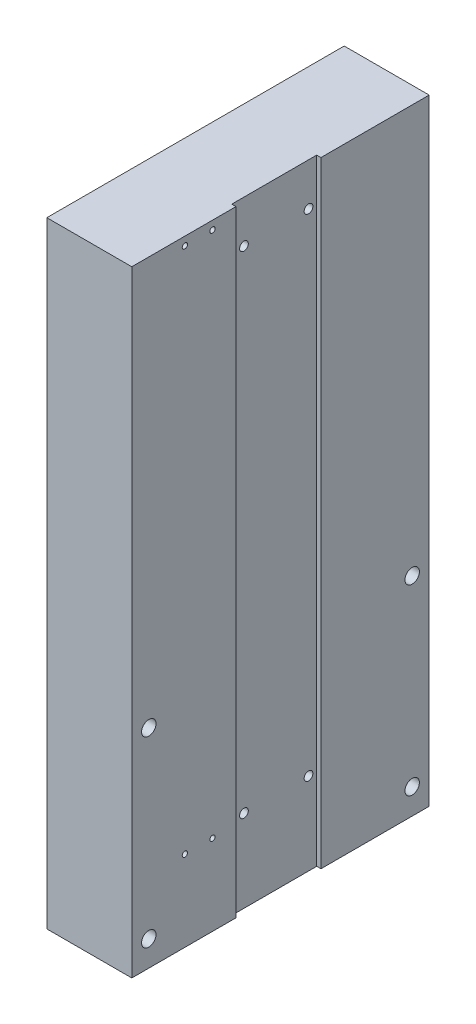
ISO-10303-21;
HEADER;
FILE_DESCRIPTION(('STEP AP214'),'2;1');
FILE_NAME('part.step','',(''),(''),'','','');
FILE_SCHEMA(('AUTOMOTIVE_DESIGN { 1 0 10303 214 1 1 1 1 }'));
ENDSEC;
DATA;
#1=APPLICATION_CONTEXT('core data for automotive mechanical design processes');
#2=APPLICATION_PROTOCOL_DEFINITION('international standard','automotive_design',2000,#1);
#3=PRODUCT_CONTEXT('',#1,'mechanical');
#4=PRODUCT('Part','Part','',(#3));
#5=PRODUCT_RELATED_PRODUCT_CATEGORY('part','',(#4));
#6=PRODUCT_DEFINITION_FORMATION('','',#4);
#7=PRODUCT_DEFINITION_CONTEXT('part definition',#1,'design');
#8=PRODUCT_DEFINITION('design','',#6,#7);
#9=PRODUCT_DEFINITION_SHAPE('','',#8);
#10=(LENGTH_UNIT() NAMED_UNIT(*) SI_UNIT(.MILLI.,.METRE.));
#11=(NAMED_UNIT(*) PLANE_ANGLE_UNIT() SI_UNIT($,.RADIAN.));
#12=(NAMED_UNIT(*) SI_UNIT($,.STERADIAN.) SOLID_ANGLE_UNIT());
#13=UNCERTAINTY_MEASURE_WITH_UNIT(LENGTH_MEASURE(1.E-05),#10,'distance_accuracy_value','');
#14=(GEOMETRIC_REPRESENTATION_CONTEXT(3) GLOBAL_UNCERTAINTY_ASSIGNED_CONTEXT((#13)) GLOBAL_UNIT_ASSIGNED_CONTEXT((#10,
#11,#12)) REPRESENTATION_CONTEXT('',''));
#15=CARTESIAN_POINT('',(0.,0.,0.));
#16=DIRECTION('',(0.,0.,1.));
#17=DIRECTION('',(1.,0.,0.));
#18=AXIS2_PLACEMENT_3D('',#15,#16,#17);
#19=CARTESIAN_POINT('',(-20.,0.,0.));
#20=DIRECTION('',(1.,0.,0.));
#21=DIRECTION('',(0.,0.,-1.));
#22=AXIS2_PLACEMENT_3D('',#19,#20,#21);
#23=PLANE('',#22);
#24=CARTESIAN_POINT('',(-20.,6.00000000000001,-31.));
#25=DIRECTION('',(-1.,0.,0.));
#26=DIRECTION('',(0.,0.,1.));
#27=AXIS2_PLACEMENT_3D('',#24,#25,#26);
#28=CIRCLE('',#27,3.25);
#29=CARTESIAN_POINT('',(-20.,6.00000000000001,-27.75));
#30=VERTEX_POINT('',#29);
#31=EDGE_CURVE('E211',#30,#30,#28,.T.);
#32=ORIENTED_EDGE('',*,*,#31,.F.);
#33=EDGE_LOOP('',(#32));
#34=FACE_BOUND('',#33,.T.);
#35=CARTESIAN_POINT('',(-20.,49.,-31.));
#36=DIRECTION('',(-1.,0.,0.));
#37=DIRECTION('',(0.,0.,1.));
#38=AXIS2_PLACEMENT_3D('',#35,#36,#37);
#39=CIRCLE('',#38,3.25);
#40=CARTESIAN_POINT('',(-20.,49.,-27.75));
#41=VERTEX_POINT('',#40);
#42=EDGE_CURVE('E223',#41,#41,#39,.T.);
#43=ORIENTED_EDGE('',*,*,#42,.F.);
#44=EDGE_LOOP('',(#43));
#45=FACE_BOUND('',#44,.T.);
#46=DIRECTION('',(0.,-1.,0.));
#47=VECTOR('',#46,1.);
#48=CARTESIAN_POINT('',(-20.,145.,35.));
#49=LINE('',#48,#47);
#50=CARTESIAN_POINT('',(-20.,145.,35.));
#51=VERTEX_POINT('',#50);
#52=CARTESIAN_POINT('',(-20.,0.,35.));
#53=VERTEX_POINT('',#52);
#54=EDGE_CURVE('E346',#51,#53,#49,.T.);
#55=ORIENTED_EDGE('',*,*,#54,.F.);
#56=DIRECTION('',(0.,0.,1.));
#57=VECTOR('',#56,1.);
#58=CARTESIAN_POINT('',(-20.,145.,35.));
#59=LINE('',#58,#57);
#60=CARTESIAN_POINT('',(-20.,145.,-35.));
#61=VERTEX_POINT('',#60);
#62=EDGE_CURVE('E356',#61,#51,#59,.T.);
#63=ORIENTED_EDGE('',*,*,#62,.F.);
#64=DIRECTION('',(0.,1.,0.));
#65=VECTOR('',#64,1.);
#66=CARTESIAN_POINT('',(-20.,145.,-35.));
#67=LINE('',#66,#65);
#68=CARTESIAN_POINT('',(-20.,0.,-35.));
#69=VERTEX_POINT('',#68);
#70=EDGE_CURVE('E353',#69,#61,#67,.T.);
#71=ORIENTED_EDGE('',*,*,#70,.F.);
#72=DIRECTION('',(0.,0.,-1.));
#73=VECTOR('',#72,1.);
#74=CARTESIAN_POINT('',(-20.,0.,35.));
#75=LINE('',#74,#73);
#76=EDGE_CURVE('E349',#53,#69,#75,.T.);
#77=ORIENTED_EDGE('',*,*,#76,.F.);
#78=EDGE_LOOP('',(#55,#63,#71,#77));
#79=FACE_BOUND('',#78,.T.);
#80=DIRECTION('',(0.,0.,1.));
#81=VECTOR('',#80,1.);
#82=CARTESIAN_POINT('',(-20.,8.00000000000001,-22.));
#83=LINE('',#82,#81);
#84=CARTESIAN_POINT('',(-20.,8.00000000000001,-22.));
#85=VERTEX_POINT('',#84);
#86=CARTESIAN_POINT('',(-20.,8.00000000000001,22.));
#87=VERTEX_POINT('',#86);
#88=EDGE_CURVE('E286',#85,#87,#83,.T.);
#89=ORIENTED_EDGE('',*,*,#88,.F.);
#90=CARTESIAN_POINT('',(-20.,13.,-22.));
#91=DIRECTION('',(-1.,0.,0.));
#92=DIRECTION('',(0.,0.,1.));
#93=AXIS2_PLACEMENT_3D('',#90,#91,#92);
#94=CIRCLE('',#93,5.);
#95=CARTESIAN_POINT('',(-20.,13.,-27.));
#96=VERTEX_POINT('',#95);
#97=EDGE_CURVE('E53',#96,#85,#94,.T.);
#98=ORIENTED_EDGE('',*,*,#97,.F.);
#99=DIRECTION('',(0.,-1.,0.));
#100=VECTOR('',#99,1.);
#101=CARTESIAN_POINT('',(-20.,132.,-27.));
#102=LINE('',#101,#100);
#103=CARTESIAN_POINT('',(-20.,132.,-27.));
#104=VERTEX_POINT('',#103);
#105=EDGE_CURVE('E263',#104,#96,#102,.T.);
#106=ORIENTED_EDGE('',*,*,#105,.F.);
#107=CARTESIAN_POINT('',(-20.,132.,-22.));
#108=DIRECTION('',(-1.,0.,0.));
#109=DIRECTION('',(0.,0.,1.));
#110=AXIS2_PLACEMENT_3D('',#107,#108,#109);
#111=CIRCLE('',#110,5.);
#112=CARTESIAN_POINT('',(-20.,137.,-22.));
#113=VERTEX_POINT('',#112);
#114=EDGE_CURVE('E301',#113,#104,#111,.T.);
#115=ORIENTED_EDGE('',*,*,#114,.F.);
#116=DIRECTION('',(0.,0.,-1.));
#117=VECTOR('',#116,1.);
#118=CARTESIAN_POINT('',(-20.,137.,22.));
#119=LINE('',#118,#117);
#120=CARTESIAN_POINT('',(-20.,137.,22.));
#121=VERTEX_POINT('',#120);
#122=EDGE_CURVE('E298',#121,#113,#119,.T.);
#123=ORIENTED_EDGE('',*,*,#122,.F.);
#124=CARTESIAN_POINT('',(-20.,132.,22.));
#125=DIRECTION('',(-1.,0.,0.));
#126=DIRECTION('',(0.,0.,1.));
#127=AXIS2_PLACEMENT_3D('',#124,#125,#126);
#128=CIRCLE('',#127,5.);
#129=CARTESIAN_POINT('',(-20.,132.,27.));
#130=VERTEX_POINT('',#129);
#131=EDGE_CURVE('E295',#130,#121,#128,.T.);
#132=ORIENTED_EDGE('',*,*,#131,.F.);
#133=DIRECTION('',(0.,1.,0.));
#134=VECTOR('',#133,1.);
#135=CARTESIAN_POINT('',(-20.,13.0000000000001,27.));
#136=LINE('',#135,#134);
#137=CARTESIAN_POINT('',(-20.,13.0000000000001,27.));
#138=VERTEX_POINT('',#137);
#139=EDGE_CURVE('E292',#138,#130,#136,.T.);
#140=ORIENTED_EDGE('',*,*,#139,.F.);
#141=CARTESIAN_POINT('',(-20.,13.,22.));
#142=DIRECTION('',(-1.,0.,0.));
#143=DIRECTION('',(0.,0.,1.));
#144=AXIS2_PLACEMENT_3D('',#141,#142,#143);
#145=CIRCLE('',#144,5.);
#146=EDGE_CURVE('E289',#87,#138,#145,.T.);
#147=ORIENTED_EDGE('',*,*,#146,.F.);
#148=EDGE_LOOP('',(#89,#98,#106,#115,#123,#132,#140,#147));
#149=FACE_BOUND('',#148,.T.);
#150=CARTESIAN_POINT('',(-20.,6.00000000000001,31.));
#151=DIRECTION('',(-1.,0.,0.));
#152=DIRECTION('',(0.,0.,1.));
#153=AXIS2_PLACEMENT_3D('',#150,#151,#152);
#154=CIRCLE('',#153,3.25);
#155=CARTESIAN_POINT('',(-20.,6.00000000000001,34.25));
#156=VERTEX_POINT('',#155);
#157=EDGE_CURVE('E247',#156,#156,#154,.T.);
#158=ORIENTED_EDGE('',*,*,#157,.F.);
#159=EDGE_LOOP('',(#158));
#160=FACE_BOUND('',#159,.T.);
#161=CARTESIAN_POINT('',(-20.,49.,31.));
#162=DIRECTION('',(-1.,0.,0.));
#163=DIRECTION('',(0.,0.,1.));
#164=AXIS2_PLACEMENT_3D('',#161,#162,#163);
#165=CIRCLE('',#164,3.25);
#166=CARTESIAN_POINT('',(-20.,49.,34.25));
#167=VERTEX_POINT('',#166);
#168=EDGE_CURVE('E235',#167,#167,#165,.T.);
#169=ORIENTED_EDGE('',*,*,#168,.F.);
#170=EDGE_LOOP('',(#169));
#171=FACE_BOUND('',#170,.T.);
#172=ADVANCED_FACE('F36',(#34,#45,#79,#149,#160,#171),#23,.F.);
#173=CARTESIAN_POINT('',(0.,0.,0.));
#174=DIRECTION('',(1.,0.,0.));
#175=DIRECTION('',(0.,0.,-1.));
#176=AXIS2_PLACEMENT_3D('',#173,#174,#175);
#177=PLANE('',#176);
#178=CARTESIAN_POINT('',(0.,143.,16.));
#179=DIRECTION('',(1.,0.,0.));
#180=DIRECTION('',(0.,0.,-1.));
#181=AXIS2_PLACEMENT_3D('',#178,#179,#180);
#182=CIRCLE('',#181,0.624999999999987);
#183=CARTESIAN_POINT('',(0.,143.,15.375));
#184=VERTEX_POINT('',#183);
#185=EDGE_CURVE('E172',#184,#184,#182,.T.);
#186=ORIENTED_EDGE('',*,*,#185,.F.);
#187=EDGE_LOOP('',(#186));
#188=FACE_BOUND('',#187,.T.);
#189=CARTESIAN_POINT('',(0.,143.,22.5));
#190=DIRECTION('',(1.,0.,0.));
#191=DIRECTION('',(0.,0.,-1.));
#192=AXIS2_PLACEMENT_3D('',#189,#190,#191);
#193=CIRCLE('',#192,0.624999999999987);
#194=CARTESIAN_POINT('',(0.,143.,21.875));
#195=VERTEX_POINT('',#194);
#196=EDGE_CURVE('E171',#195,#195,#193,.T.);
#197=ORIENTED_EDGE('',*,*,#196,.F.);
#198=EDGE_LOOP('',(#197));
#199=FACE_BOUND('',#198,.T.);
#200=CARTESIAN_POINT('',(0.,19.,16.));
#201=DIRECTION('',(1.,0.,0.));
#202=DIRECTION('',(0.,0.,-1.));
#203=AXIS2_PLACEMENT_3D('',#200,#201,#202);
#204=CIRCLE('',#203,0.625000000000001);
#205=CARTESIAN_POINT('',(0.,19.,15.375));
#206=VERTEX_POINT('',#205);
#207=EDGE_CURVE('E182',#206,#206,#204,.T.);
#208=ORIENTED_EDGE('',*,*,#207,.F.);
#209=EDGE_LOOP('',(#208));
#210=FACE_BOUND('',#209,.T.);
#211=CARTESIAN_POINT('',(0.,19.,22.5));
#212=DIRECTION('',(1.,0.,0.));
#213=DIRECTION('',(0.,0.,-1.));
#214=AXIS2_PLACEMENT_3D('',#211,#212,#213);
#215=CIRCLE('',#214,0.625000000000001);
#216=CARTESIAN_POINT('',(0.,19.,21.875));
#217=VERTEX_POINT('',#216);
#218=EDGE_CURVE('E188',#217,#217,#215,.T.);
#219=ORIENTED_EDGE('',*,*,#218,.F.);
#220=EDGE_LOOP('',(#219));
#221=FACE_BOUND('',#220,.T.);
#222=CARTESIAN_POINT('',(0.,49.,31.));
#223=DIRECTION('',(-1.,0.,0.));
#224=DIRECTION('',(0.,0.,1.));
#225=AXIS2_PLACEMENT_3D('',#222,#223,#224);
#226=CIRCLE('',#225,1.69999999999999);
#227=CARTESIAN_POINT('',(0.,49.,32.7));
#228=VERTEX_POINT('',#227);
#229=EDGE_CURVE('E244',#228,#228,#226,.T.);
#230=ORIENTED_EDGE('',*,*,#229,.T.);
#231=EDGE_LOOP('',(#230));
#232=FACE_BOUND('',#231,.T.);
#233=CARTESIAN_POINT('',(0.,6.00000000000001,31.));
#234=DIRECTION('',(-1.,0.,0.));
#235=DIRECTION('',(0.,0.,1.));
#236=AXIS2_PLACEMENT_3D('',#233,#234,#235);
#237=CIRCLE('',#236,1.69999999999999);
#238=CARTESIAN_POINT('',(0.,6.00000000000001,32.7));
#239=VERTEX_POINT('',#238);
#240=EDGE_CURVE('E256',#239,#239,#237,.T.);
#241=ORIENTED_EDGE('',*,*,#240,.T.);
#242=EDGE_LOOP('',(#241));
#243=FACE_BOUND('',#242,.T.);
#244=DIRECTION('',(0.,-1.,0.));
#245=VECTOR('',#244,1.);
#246=CARTESIAN_POINT('',(0.,145.,10.475));
#247=LINE('',#246,#245);
#248=CARTESIAN_POINT('',(0.,145.,10.475));
#249=VERTEX_POINT('',#248);
#250=CARTESIAN_POINT('',(0.,0.,10.475));
#251=VERTEX_POINT('',#250);
#252=EDGE_CURVE('E341',#249,#251,#247,.T.);
#253=ORIENTED_EDGE('',*,*,#252,.F.);
#254=DIRECTION('',(0.,0.,1.));
#255=VECTOR('',#254,1.);
#256=CARTESIAN_POINT('',(0.,145.,35.));
#257=LINE('',#256,#255);
#258=CARTESIAN_POINT('',(0.,145.,35.));
#259=VERTEX_POINT('',#258);
#260=EDGE_CURVE('E369',#249,#259,#257,.T.);
#261=ORIENTED_EDGE('',*,*,#260,.T.);
#262=DIRECTION('',(0.,-1.,0.));
#263=VECTOR('',#262,1.);
#264=CARTESIAN_POINT('',(0.,145.,35.));
#265=LINE('',#264,#263);
#266=CARTESIAN_POINT('',(0.,0.,35.));
#267=VERTEX_POINT('',#266);
#268=EDGE_CURVE('E340',#259,#267,#265,.T.);
#269=ORIENTED_EDGE('',*,*,#268,.T.);
#270=DIRECTION('',(0.,0.,-1.));
#271=VECTOR('',#270,1.);
#272=CARTESIAN_POINT('',(0.,0.,35.));
#273=LINE('',#272,#271);
#274=EDGE_CURVE('E363',#267,#251,#273,.T.);
#275=ORIENTED_EDGE('',*,*,#274,.T.);
#276=EDGE_LOOP('',(#253,#261,#269,#275));
#277=FACE_BOUND('',#276,.T.);
#278=ADVANCED_FACE('F433',(#188,#199,#210,#221,#232,#243,#277),#177,.T.);
#279=CARTESIAN_POINT('',(-20.,145.,35.));
#280=DIRECTION('',(0.,0.,1.));
#281=DIRECTION('',(0.,-1.,0.));
#282=AXIS2_PLACEMENT_3D('',#279,#280,#281);
#283=PLANE('',#282);
#284=ORIENTED_EDGE('',*,*,#268,.F.);
#285=DIRECTION('',(1.,0.,0.));
#286=VECTOR('',#285,1.);
#287=CARTESIAN_POINT('',(-20.,145.,35.));
#288=LINE('',#287,#286);
#289=EDGE_CURVE('E11',#51,#259,#288,.T.);
#290=ORIENTED_EDGE('',*,*,#289,.F.);
#291=ORIENTED_EDGE('',*,*,#54,.T.);
#292=DIRECTION('',(1.,0.,0.));
#293=VECTOR('',#292,1.);
#294=CARTESIAN_POINT('',(-20.,0.,35.));
#295=LINE('',#294,#293);
#296=EDGE_CURVE('E359',#53,#267,#295,.T.);
#297=ORIENTED_EDGE('',*,*,#296,.T.);
#298=EDGE_LOOP('',(#284,#290,#291,#297));
#299=FACE_BOUND('',#298,.T.);
#300=ADVANCED_FACE('F38',(#299),#283,.T.);
#301=CARTESIAN_POINT('',(-20.,145.,35.));
#302=DIRECTION('',(0.,1.,0.));
#303=DIRECTION('',(0.,0.,1.));
#304=AXIS2_PLACEMENT_3D('',#301,#302,#303);
#305=PLANE('',#304);
#306=DIRECTION('',(-1.,0.,0.));
#307=VECTOR('',#306,1.);
#308=CARTESIAN_POINT('',(-0.999999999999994,145.,10.475));
#309=LINE('',#308,#307);
#310=CARTESIAN_POINT('',(-0.999999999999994,145.,10.475));
#311=VERTEX_POINT('',#310);
#312=EDGE_CURVE('E329',#249,#311,#309,.T.);
#313=ORIENTED_EDGE('',*,*,#312,.T.);
#314=DIRECTION('',(0.,0.,-1.));
#315=VECTOR('',#314,1.);
#316=CARTESIAN_POINT('',(-0.999999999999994,145.,10.475));
#317=LINE('',#316,#315);
#318=CARTESIAN_POINT('',(-0.999999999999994,145.,-9.525));
#319=VERTEX_POINT('',#318);
#320=EDGE_CURVE('E322',#311,#319,#317,.T.);
#321=ORIENTED_EDGE('',*,*,#320,.T.);
#322=DIRECTION('',(1.,0.,0.));
#323=VECTOR('',#322,1.);
#324=CARTESIAN_POINT('',(-0.999999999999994,145.,-9.525));
#325=LINE('',#324,#323);
#326=CARTESIAN_POINT('',(0.,145.,-9.525));
#327=VERTEX_POINT('',#326);
#328=EDGE_CURVE('E325',#319,#327,#325,.T.);
#329=ORIENTED_EDGE('',*,*,#328,.T.);
#330=CARTESIAN_POINT('',(0.,145.,-35.));
#331=VERTEX_POINT('',#330);
#332=EDGE_CURVE('E350',#331,#327,#257,.T.);
#333=ORIENTED_EDGE('',*,*,#332,.F.);
#334=DIRECTION('',(1.,0.,0.));
#335=VECTOR('',#334,1.);
#336=CARTESIAN_POINT('',(-20.,145.,-35.));
#337=LINE('',#336,#335);
#338=EDGE_CURVE('E45',#61,#331,#337,.T.);
#339=ORIENTED_EDGE('',*,*,#338,.F.);
#340=ORIENTED_EDGE('',*,*,#62,.T.);
#341=ORIENTED_EDGE('',*,*,#289,.T.);
#342=ORIENTED_EDGE('',*,*,#260,.F.);
#343=EDGE_LOOP('',(#313,#321,#329,#333,#339,#340,#341,#342));
#344=FACE_BOUND('',#343,.T.);
#345=ADVANCED_FACE('F451',(#344),#305,.T.);
#346=CARTESIAN_POINT('',(-20.,145.,-35.));
#347=DIRECTION('',(0.,0.,-1.));
#348=DIRECTION('',(0.,1.,0.));
#349=AXIS2_PLACEMENT_3D('',#346,#347,#348);
#350=PLANE('',#349);
#351=DIRECTION('',(0.,1.,0.));
#352=VECTOR('',#351,1.);
#353=CARTESIAN_POINT('',(0.,145.,-35.));
#354=LINE('',#353,#352);
#355=CARTESIAN_POINT('',(0.,0.,-35.));
#356=VERTEX_POINT('',#355);
#357=EDGE_CURVE('E366',#356,#331,#354,.T.);
#358=ORIENTED_EDGE('',*,*,#357,.F.);
#359=DIRECTION('',(1.,0.,0.));
#360=VECTOR('',#359,1.);
#361=CARTESIAN_POINT('',(-20.,0.,-35.));
#362=LINE('',#361,#360);
#363=EDGE_CURVE('E373',#69,#356,#362,.T.);
#364=ORIENTED_EDGE('',*,*,#363,.F.);
#365=ORIENTED_EDGE('',*,*,#70,.T.);
#366=ORIENTED_EDGE('',*,*,#338,.T.);
#367=EDGE_LOOP('',(#358,#364,#365,#366));
#368=FACE_BOUND('',#367,.T.);
#369=ADVANCED_FACE('F454',(#368),#350,.T.);
#370=CARTESIAN_POINT('',(-20.,0.,35.));
#371=DIRECTION('',(0.,-1.,0.));
#372=DIRECTION('',(0.,0.,-1.));
#373=AXIS2_PLACEMENT_3D('',#370,#371,#372);
#374=PLANE('',#373);
#375=DIRECTION('',(-1.,0.,0.));
#376=VECTOR('',#375,1.);
#377=CARTESIAN_POINT('',(-1.,0.,10.475));
#378=LINE('',#377,#376);
#379=CARTESIAN_POINT('',(-1.,0.,10.475));
#380=VERTEX_POINT('',#379);
#381=EDGE_CURVE('E326',#251,#380,#378,.T.);
#382=ORIENTED_EDGE('',*,*,#381,.F.);
#383=ORIENTED_EDGE('',*,*,#274,.F.);
#384=ORIENTED_EDGE('',*,*,#296,.F.);
#385=ORIENTED_EDGE('',*,*,#76,.T.);
#386=ORIENTED_EDGE('',*,*,#363,.T.);
#387=CARTESIAN_POINT('',(0.,0.,-9.525));
#388=VERTEX_POINT('',#387);
#389=EDGE_CURVE('E362',#388,#356,#273,.T.);
#390=ORIENTED_EDGE('',*,*,#389,.F.);
#391=DIRECTION('',(1.,0.,0.));
#392=VECTOR('',#391,1.);
#393=CARTESIAN_POINT('',(-1.,0.,-9.525));
#394=LINE('',#393,#392);
#395=CARTESIAN_POINT('',(-1.,0.,-9.525));
#396=VERTEX_POINT('',#395);
#397=EDGE_CURVE('E61',#396,#388,#394,.T.);
#398=ORIENTED_EDGE('',*,*,#397,.F.);
#399=DIRECTION('',(0.,0.,-1.));
#400=VECTOR('',#399,1.);
#401=CARTESIAN_POINT('',(-1.,0.,10.475));
#402=LINE('',#401,#400);
#403=EDGE_CURVE('E308',#380,#396,#402,.T.);
#404=ORIENTED_EDGE('',*,*,#403,.F.);
#405=EDGE_LOOP('',(#382,#383,#384,#385,#386,#390,#398,#404));
#406=FACE_BOUND('',#405,.T.);
#407=ADVANCED_FACE('F449',(#406),#374,.T.);
#408=CARTESIAN_POINT('',(0.,6.00000000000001,-31.));
#409=DIRECTION('',(-1.,0.,0.));
#410=DIRECTION('',(0.,0.,1.));
#411=AXIS2_PLACEMENT_3D('',#408,#409,#410);
#412=CIRCLE('',#411,1.69999999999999);
#413=CARTESIAN_POINT('',(0.,6.00000000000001,-29.3));
#414=VERTEX_POINT('',#413);
#415=EDGE_CURVE('E220',#414,#414,#412,.T.);
#416=ORIENTED_EDGE('',*,*,#415,.T.);
#417=EDGE_LOOP('',(#416));
#418=FACE_BOUND('',#417,.T.);
#419=CARTESIAN_POINT('',(0.,49.,-31.));
#420=DIRECTION('',(-1.,0.,0.));
#421=DIRECTION('',(0.,0.,1.));
#422=AXIS2_PLACEMENT_3D('',#419,#420,#421);
#423=CIRCLE('',#422,1.69999999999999);
#424=CARTESIAN_POINT('',(0.,49.,-29.3));
#425=VERTEX_POINT('',#424);
#426=EDGE_CURVE('E232',#425,#425,#423,.T.);
#427=ORIENTED_EDGE('',*,*,#426,.T.);
#428=EDGE_LOOP('',(#427));
#429=FACE_BOUND('',#428,.T.);
#430=DIRECTION('',(0.,-1.,0.));
#431=VECTOR('',#430,1.);
#432=CARTESIAN_POINT('',(0.,145.,-9.525));
#433=LINE('',#432,#431);
#434=EDGE_CURVE('E343',#327,#388,#433,.T.);
#435=ORIENTED_EDGE('',*,*,#434,.T.);
#436=ORIENTED_EDGE('',*,*,#389,.T.);
#437=ORIENTED_EDGE('',*,*,#357,.T.);
#438=ORIENTED_EDGE('',*,*,#332,.T.);
#439=EDGE_LOOP('',(#435,#436,#437,#438));
#440=FACE_BOUND('',#439,.T.);
#441=ADVANCED_FACE('F441',(#418,#429,#440),#177,.T.);
#442=CARTESIAN_POINT('',(-0.999999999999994,145.,10.475));
#443=DIRECTION('',(-1.,0.,0.));
#444=DIRECTION('',(0.,0.,1.));
#445=AXIS2_PLACEMENT_3D('',#442,#443,#444);
#446=PLANE('',#445);
#447=CARTESIAN_POINT('',(-0.999999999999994,135.,-7.6));
#448=DIRECTION('',(1.,0.,0.));
#449=DIRECTION('',(0.,0.,-1.));
#450=AXIS2_PLACEMENT_3D('',#447,#448,#449);
#451=CIRCLE('',#450,1.025);
#452=CARTESIAN_POINT('',(-0.999999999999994,135.,-8.625));
#453=VERTEX_POINT('',#452);
#454=EDGE_CURVE('E194',#453,#453,#451,.T.);
#455=ORIENTED_EDGE('',*,*,#454,.F.);
#456=EDGE_LOOP('',(#455));
#457=FACE_BOUND('',#456,.T.);
#458=CARTESIAN_POINT('',(-0.999999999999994,19.4,-7.6));
#459=DIRECTION('',(1.,0.,0.));
#460=DIRECTION('',(0.,0.,-1.));
#461=AXIS2_PLACEMENT_3D('',#458,#459,#460);
#462=CIRCLE('',#461,1.02499999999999);
#463=CARTESIAN_POINT('',(-0.999999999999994,19.4,-8.62499999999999));
#464=VERTEX_POINT('',#463);
#465=EDGE_CURVE('E200',#464,#464,#462,.T.);
#466=ORIENTED_EDGE('',*,*,#465,.F.);
#467=EDGE_LOOP('',(#466));
#468=FACE_BOUND('',#467,.T.);
#469=CARTESIAN_POINT('',(-0.999999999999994,19.4,7.6));
#470=DIRECTION('',(1.,0.,0.));
#471=DIRECTION('',(0.,0.,-1.));
#472=AXIS2_PLACEMENT_3D('',#469,#470,#471);
#473=CIRCLE('',#472,1.02499999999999);
#474=CARTESIAN_POINT('',(-0.999999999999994,19.4,6.57500000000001));
#475=VERTEX_POINT('',#474);
#476=EDGE_CURVE('E203',#475,#475,#473,.T.);
#477=ORIENTED_EDGE('',*,*,#476,.F.);
#478=EDGE_LOOP('',(#477));
#479=FACE_BOUND('',#478,.T.);
#480=CARTESIAN_POINT('',(-0.999999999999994,135.,7.6));
#481=DIRECTION('',(1.,0.,0.));
#482=DIRECTION('',(0.,0.,-1.));
#483=AXIS2_PLACEMENT_3D('',#480,#481,#482);
#484=CIRCLE('',#483,1.025);
#485=CARTESIAN_POINT('',(-0.999999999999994,135.,6.575));
#486=VERTEX_POINT('',#485);
#487=EDGE_CURVE('E207',#486,#486,#484,.T.);
#488=ORIENTED_EDGE('',*,*,#487,.F.);
#489=EDGE_LOOP('',(#488));
#490=FACE_BOUND('',#489,.T.);
#491=ORIENTED_EDGE('',*,*,#403,.T.);
#492=DIRECTION('',(0.,-1.,0.));
#493=VECTOR('',#492,1.);
#494=CARTESIAN_POINT('',(-0.999999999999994,145.,-9.525));
#495=LINE('',#494,#493);
#496=EDGE_CURVE('E332',#319,#396,#495,.T.);
#497=ORIENTED_EDGE('',*,*,#496,.F.);
#498=ORIENTED_EDGE('',*,*,#320,.F.);
#499=DIRECTION('',(0.,-1.,0.));
#500=VECTOR('',#499,1.);
#501=CARTESIAN_POINT('',(-0.999999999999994,145.,10.475));
#502=LINE('',#501,#500);
#503=EDGE_CURVE('E338',#311,#380,#502,.T.);
#504=ORIENTED_EDGE('',*,*,#503,.T.);
#505=EDGE_LOOP('',(#491,#497,#498,#504));
#506=FACE_BOUND('',#505,.T.);
#507=ADVANCED_FACE('F445',(#457,#468,#479,#490,#506),#446,.F.);
#508=CARTESIAN_POINT('',(-0.999999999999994,145.,10.475));
#509=DIRECTION('',(0.,0.,1.));
#510=DIRECTION('',(1.,0.,0.));
#511=AXIS2_PLACEMENT_3D('',#508,#509,#510);
#512=PLANE('',#511);
#513=ORIENTED_EDGE('',*,*,#381,.T.);
#514=ORIENTED_EDGE('',*,*,#503,.F.);
#515=ORIENTED_EDGE('',*,*,#312,.F.);
#516=ORIENTED_EDGE('',*,*,#252,.T.);
#517=EDGE_LOOP('',(#513,#514,#515,#516));
#518=FACE_BOUND('',#517,.T.);
#519=ADVANCED_FACE('F484',(#518),#512,.F.);
#520=CARTESIAN_POINT('',(-0.999999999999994,145.,-9.525));
#521=DIRECTION('',(0.,0.,-1.));
#522=DIRECTION('',(-1.,0.,0.));
#523=AXIS2_PLACEMENT_3D('',#520,#521,#522);
#524=PLANE('',#523);
#525=ORIENTED_EDGE('',*,*,#397,.T.);
#526=ORIENTED_EDGE('',*,*,#434,.F.);
#527=ORIENTED_EDGE('',*,*,#328,.F.);
#528=ORIENTED_EDGE('',*,*,#496,.T.);
#529=EDGE_LOOP('',(#525,#526,#527,#528));
#530=FACE_BOUND('',#529,.T.);
#531=ADVANCED_FACE('F481',(#530),#524,.F.);
#532=CARTESIAN_POINT('',(-8.,13.,-22.));
#533=DIRECTION('',(-1.,0.,0.));
#534=DIRECTION('',(0.,0.,1.));
#535=AXIS2_PLACEMENT_3D('',#532,#533,#534);
#536=CYLINDRICAL_SURFACE('',#535,5.);
#537=ORIENTED_EDGE('',*,*,#97,.T.);
#538=DIRECTION('',(-1.,0.,0.));
#539=VECTOR('',#538,1.);
#540=CARTESIAN_POINT('',(-8.,8.00000000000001,-22.));
#541=LINE('',#540,#539);
#542=CARTESIAN_POINT('',(-8.,8.00000000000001,-22.));
#543=VERTEX_POINT('',#542);
#544=EDGE_CURVE('E284',#543,#85,#541,.T.);
#545=ORIENTED_EDGE('',*,*,#544,.F.);
#546=CARTESIAN_POINT('',(-8.,13.,-22.));
#547=DIRECTION('',(-1.,0.,0.));
#548=DIRECTION('',(0.,0.,1.));
#549=AXIS2_PLACEMENT_3D('',#546,#547,#548);
#550=CIRCLE('',#549,5.);
#551=CARTESIAN_POINT('',(-8.,13.,-27.));
#552=VERTEX_POINT('',#551);
#553=EDGE_CURVE('E259',#552,#543,#550,.T.);
#554=ORIENTED_EDGE('',*,*,#553,.F.);
#555=DIRECTION('',(-1.,0.,0.));
#556=VECTOR('',#555,1.);
#557=CARTESIAN_POINT('',(-8.,13.,-27.));
#558=LINE('',#557,#556);
#559=EDGE_CURVE('E306',#552,#96,#558,.T.);
#560=ORIENTED_EDGE('',*,*,#559,.T.);
#561=EDGE_LOOP('',(#537,#545,#554,#560));
#562=FACE_BOUND('',#561,.T.);
#563=ADVANCED_FACE('F396',(#562),#536,.F.);
#564=CARTESIAN_POINT('',(-8.,132.,-27.));
#565=DIRECTION('',(0.,0.,-1.));
#566=DIRECTION('',(0.,1.,0.));
#567=AXIS2_PLACEMENT_3D('',#564,#565,#566);
#568=PLANE('',#567);
#569=ORIENTED_EDGE('',*,*,#105,.T.);
#570=ORIENTED_EDGE('',*,*,#559,.F.);
#571=DIRECTION('',(0.,-1.,0.));
#572=VECTOR('',#571,1.);
#573=CARTESIAN_POINT('',(-8.,132.,-27.));
#574=LINE('',#573,#572);
#575=CARTESIAN_POINT('',(-8.,132.,-27.));
#576=VERTEX_POINT('',#575);
#577=EDGE_CURVE('E281',#576,#552,#574,.T.);
#578=ORIENTED_EDGE('',*,*,#577,.F.);
#579=DIRECTION('',(-1.,0.,0.));
#580=VECTOR('',#579,1.);
#581=CARTESIAN_POINT('',(-8.,132.,-27.));
#582=LINE('',#581,#580);
#583=EDGE_CURVE('E309',#576,#104,#582,.T.);
#584=ORIENTED_EDGE('',*,*,#583,.T.);
#585=EDGE_LOOP('',(#569,#570,#578,#584));
#586=FACE_BOUND('',#585,.T.);
#587=ADVANCED_FACE('F418',(#586),#568,.F.);
#588=CARTESIAN_POINT('',(-8.,132.,-22.));
#589=DIRECTION('',(-1.,0.,0.));
#590=DIRECTION('',(0.,0.,1.));
#591=AXIS2_PLACEMENT_3D('',#588,#589,#590);
#592=CYLINDRICAL_SURFACE('',#591,5.);
#593=ORIENTED_EDGE('',*,*,#114,.T.);
#594=ORIENTED_EDGE('',*,*,#583,.F.);
#595=CARTESIAN_POINT('',(-8.,132.,-22.));
#596=DIRECTION('',(-1.,0.,0.));
#597=DIRECTION('',(0.,0.,1.));
#598=AXIS2_PLACEMENT_3D('',#595,#596,#597);
#599=CIRCLE('',#598,5.);
#600=CARTESIAN_POINT('',(-8.,137.,-22.));
#601=VERTEX_POINT('',#600);
#602=EDGE_CURVE('E278',#601,#576,#599,.T.);
#603=ORIENTED_EDGE('',*,*,#602,.F.);
#604=DIRECTION('',(-1.,0.,0.));
#605=VECTOR('',#604,1.);
#606=CARTESIAN_POINT('',(-8.,137.,-22.));
#607=LINE('',#606,#605);
#608=EDGE_CURVE('E311',#601,#113,#607,.T.);
#609=ORIENTED_EDGE('',*,*,#608,.T.);
#610=EDGE_LOOP('',(#593,#594,#603,#609));
#611=FACE_BOUND('',#610,.T.);
#612=ADVANCED_FACE('F423',(#611),#592,.F.);
#613=CARTESIAN_POINT('',(-8.,137.,22.));
#614=DIRECTION('',(0.,1.,0.));
#615=DIRECTION('',(0.,0.,1.));
#616=AXIS2_PLACEMENT_3D('',#613,#614,#615);
#617=PLANE('',#616);
#618=ORIENTED_EDGE('',*,*,#122,.T.);
#619=ORIENTED_EDGE('',*,*,#608,.F.);
#620=DIRECTION('',(0.,0.,-1.));
#621=VECTOR('',#620,1.);
#622=CARTESIAN_POINT('',(-8.,137.,22.));
#623=LINE('',#622,#621);
#624=CARTESIAN_POINT('',(-8.,137.,22.));
#625=VERTEX_POINT('',#624);
#626=EDGE_CURVE('E275',#625,#601,#623,.T.);
#627=ORIENTED_EDGE('',*,*,#626,.F.);
#628=DIRECTION('',(-1.,0.,0.));
#629=VECTOR('',#628,1.);
#630=CARTESIAN_POINT('',(-8.,137.,22.));
#631=LINE('',#630,#629);
#632=EDGE_CURVE('E313',#625,#121,#631,.T.);
#633=ORIENTED_EDGE('',*,*,#632,.T.);
#634=EDGE_LOOP('',(#618,#619,#627,#633));
#635=FACE_BOUND('',#634,.T.);
#636=ADVANCED_FACE('F414',(#635),#617,.F.);
#637=CARTESIAN_POINT('',(-8.,132.,22.));
#638=DIRECTION('',(-1.,0.,0.));
#639=DIRECTION('',(0.,0.,1.));
#640=AXIS2_PLACEMENT_3D('',#637,#638,#639);
#641=CYLINDRICAL_SURFACE('',#640,5.);
#642=ORIENTED_EDGE('',*,*,#131,.T.);
#643=ORIENTED_EDGE('',*,*,#632,.F.);
#644=CARTESIAN_POINT('',(-8.,132.,22.));
#645=DIRECTION('',(-1.,0.,0.));
#646=DIRECTION('',(0.,0.,1.));
#647=AXIS2_PLACEMENT_3D('',#644,#645,#646);
#648=CIRCLE('',#647,5.);
#649=CARTESIAN_POINT('',(-8.,132.,27.));
#650=VERTEX_POINT('',#649);
#651=EDGE_CURVE('E272',#650,#625,#648,.T.);
#652=ORIENTED_EDGE('',*,*,#651,.F.);
#653=DIRECTION('',(-1.,0.,0.));
#654=VECTOR('',#653,1.);
#655=CARTESIAN_POINT('',(-8.,132.,27.));
#656=LINE('',#655,#654);
#657=EDGE_CURVE('E315',#650,#130,#656,.T.);
#658=ORIENTED_EDGE('',*,*,#657,.T.);
#659=EDGE_LOOP('',(#642,#643,#652,#658));
#660=FACE_BOUND('',#659,.T.);
#661=ADVANCED_FACE('F410',(#660),#641,.F.);
#662=CARTESIAN_POINT('',(-8.,13.0000000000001,27.));
#663=DIRECTION('',(0.,0.,1.));
#664=DIRECTION('',(0.,-1.,0.));
#665=AXIS2_PLACEMENT_3D('',#662,#663,#664);
#666=PLANE('',#665);
#667=ORIENTED_EDGE('',*,*,#139,.T.);
#668=ORIENTED_EDGE('',*,*,#657,.F.);
#669=DIRECTION('',(0.,1.,0.));
#670=VECTOR('',#669,1.);
#671=CARTESIAN_POINT('',(-8.,13.0000000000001,27.));
#672=LINE('',#671,#670);
#673=CARTESIAN_POINT('',(-8.,13.0000000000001,27.));
#674=VERTEX_POINT('',#673);
#675=EDGE_CURVE('E269',#674,#650,#672,.T.);
#676=ORIENTED_EDGE('',*,*,#675,.F.);
#677=DIRECTION('',(-1.,0.,0.));
#678=VECTOR('',#677,1.);
#679=CARTESIAN_POINT('',(-8.,13.0000000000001,27.));
#680=LINE('',#679,#678);
#681=EDGE_CURVE('E317',#674,#138,#680,.T.);
#682=ORIENTED_EDGE('',*,*,#681,.T.);
#683=EDGE_LOOP('',(#667,#668,#676,#682));
#684=FACE_BOUND('',#683,.T.);
#685=ADVANCED_FACE('F406',(#684),#666,.F.);
#686=CARTESIAN_POINT('',(-8.,13.,22.));
#687=DIRECTION('',(-1.,0.,0.));
#688=DIRECTION('',(0.,0.,1.));
#689=AXIS2_PLACEMENT_3D('',#686,#687,#688);
#690=CYLINDRICAL_SURFACE('',#689,5.);
#691=ORIENTED_EDGE('',*,*,#146,.T.);
#692=ORIENTED_EDGE('',*,*,#681,.F.);
#693=CARTESIAN_POINT('',(-8.,13.,22.));
#694=DIRECTION('',(-1.,0.,0.));
#695=DIRECTION('',(0.,0.,1.));
#696=AXIS2_PLACEMENT_3D('',#693,#694,#695);
#697=CIRCLE('',#696,5.);
#698=CARTESIAN_POINT('',(-8.,8.00000000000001,22.));
#699=VERTEX_POINT('',#698);
#700=EDGE_CURVE('E266',#699,#674,#697,.T.);
#701=ORIENTED_EDGE('',*,*,#700,.F.);
#702=DIRECTION('',(-1.,0.,0.));
#703=VECTOR('',#702,1.);
#704=CARTESIAN_POINT('',(-8.,8.00000000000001,22.));
#705=LINE('',#704,#703);
#706=EDGE_CURVE('E319',#699,#87,#705,.T.);
#707=ORIENTED_EDGE('',*,*,#706,.T.);
#708=EDGE_LOOP('',(#691,#692,#701,#707));
#709=FACE_BOUND('',#708,.T.);
#710=ADVANCED_FACE('F402',(#709),#690,.F.);
#711=CARTESIAN_POINT('',(-8.,8.00000000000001,-22.));
#712=DIRECTION('',(0.,-1.,0.));
#713=DIRECTION('',(0.,0.,-1.));
#714=AXIS2_PLACEMENT_3D('',#711,#712,#713);
#715=PLANE('',#714);
#716=ORIENTED_EDGE('',*,*,#88,.T.);
#717=ORIENTED_EDGE('',*,*,#706,.F.);
#718=DIRECTION('',(0.,0.,1.));
#719=VECTOR('',#718,1.);
#720=CARTESIAN_POINT('',(-8.,8.00000000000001,-22.));
#721=LINE('',#720,#719);
#722=EDGE_CURVE('E262',#543,#699,#721,.T.);
#723=ORIENTED_EDGE('',*,*,#722,.F.);
#724=ORIENTED_EDGE('',*,*,#544,.T.);
#725=EDGE_LOOP('',(#716,#717,#723,#724));
#726=FACE_BOUND('',#725,.T.);
#727=ADVANCED_FACE('F388',(#726),#715,.F.);
#728=CARTESIAN_POINT('',(-8.,13.,-22.));
#729=DIRECTION('',(-1.,0.,0.));
#730=DIRECTION('',(0.,0.,1.));
#731=AXIS2_PLACEMENT_3D('',#728,#729,#730);
#732=PLANE('',#731);
#733=CARTESIAN_POINT('',(-8.,135.,-7.6));
#734=DIRECTION('',(-1.,0.,0.));
#735=DIRECTION('',(0.,0.,1.));
#736=AXIS2_PLACEMENT_3D('',#733,#734,#735);
#737=CIRCLE('',#736,1.025);
#738=CARTESIAN_POINT('',(-8.,135.,-6.575));
#739=VERTEX_POINT('',#738);
#740=EDGE_CURVE('E197',#739,#739,#737,.T.);
#741=ORIENTED_EDGE('',*,*,#740,.F.);
#742=EDGE_LOOP('',(#741));
#743=FACE_BOUND('',#742,.T.);
#744=CARTESIAN_POINT('',(-8.,19.4,-7.6));
#745=DIRECTION('',(-1.,0.,0.));
#746=DIRECTION('',(0.,0.,1.));
#747=AXIS2_PLACEMENT_3D('',#744,#745,#746);
#748=CIRCLE('',#747,1.02499999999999);
#749=CARTESIAN_POINT('',(-8.,19.4,-6.57500000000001));
#750=VERTEX_POINT('',#749);
#751=EDGE_CURVE('E40',#750,#750,#748,.T.);
#752=ORIENTED_EDGE('',*,*,#751,.F.);
#753=EDGE_LOOP('',(#752));
#754=FACE_BOUND('',#753,.T.);
#755=CARTESIAN_POINT('',(-8.,19.4,7.6));
#756=DIRECTION('',(-1.,0.,0.));
#757=DIRECTION('',(0.,0.,1.));
#758=AXIS2_PLACEMENT_3D('',#755,#756,#757);
#759=CIRCLE('',#758,1.02499999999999);
#760=CARTESIAN_POINT('',(-8.,19.4,8.62499999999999));
#761=VERTEX_POINT('',#760);
#762=EDGE_CURVE('E206',#761,#761,#759,.T.);
#763=ORIENTED_EDGE('',*,*,#762,.F.);
#764=EDGE_LOOP('',(#763));
#765=FACE_BOUND('',#764,.T.);
#766=CARTESIAN_POINT('',(-8.,135.,7.6));
#767=DIRECTION('',(-1.,0.,0.));
#768=DIRECTION('',(0.,0.,1.));
#769=AXIS2_PLACEMENT_3D('',#766,#767,#768);
#770=CIRCLE('',#769,1.025);
#771=CARTESIAN_POINT('',(-8.,135.,8.625));
#772=VERTEX_POINT('',#771);
#773=EDGE_CURVE('E210',#772,#772,#770,.T.);
#774=ORIENTED_EDGE('',*,*,#773,.F.);
#775=EDGE_LOOP('',(#774));
#776=FACE_BOUND('',#775,.T.);
#777=ORIENTED_EDGE('',*,*,#553,.T.);
#778=ORIENTED_EDGE('',*,*,#722,.T.);
#779=ORIENTED_EDGE('',*,*,#700,.T.);
#780=ORIENTED_EDGE('',*,*,#675,.T.);
#781=ORIENTED_EDGE('',*,*,#651,.T.);
#782=ORIENTED_EDGE('',*,*,#626,.T.);
#783=ORIENTED_EDGE('',*,*,#602,.T.);
#784=ORIENTED_EDGE('',*,*,#577,.T.);
#785=EDGE_LOOP('',(#777,#778,#779,#780,#781,#782,#783,#784));
#786=FACE_BOUND('',#785,.T.);
#787=ADVANCED_FACE('F384',(#743,#754,#765,#776,#786),#732,.T.);
#788=CARTESIAN_POINT('',(-20.,6.00000000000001,31.));
#789=DIRECTION('',(-1.,0.,0.));
#790=DIRECTION('',(0.,0.,1.));
#791=AXIS2_PLACEMENT_3D('',#788,#789,#790);
#792=CYLINDRICAL_SURFACE('',#791,1.7);
#793=ORIENTED_EDGE('',*,*,#240,.F.);
#794=EDGE_LOOP('',(#793));
#795=FACE_BOUND('',#794,.T.);
#796=CARTESIAN_POINT('',(-16.6,6.00000000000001,31.));
#797=DIRECTION('',(-1.,0.,0.));
#798=DIRECTION('',(0.,0.,1.));
#799=AXIS2_PLACEMENT_3D('',#796,#797,#798);
#800=CIRCLE('',#799,1.7);
#801=CARTESIAN_POINT('',(-16.6,6.00000000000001,32.7));
#802=VERTEX_POINT('',#801);
#803=EDGE_CURVE('E253',#802,#802,#800,.T.);
#804=ORIENTED_EDGE('',*,*,#803,.T.);
#805=EDGE_LOOP('',(#804));
#806=FACE_BOUND('',#805,.T.);
#807=ADVANCED_FACE('F387',(#795,#806),#792,.F.);
#808=CARTESIAN_POINT('',(-16.6,7.70000000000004,31.));
#809=DIRECTION('',(1.,0.,0.));
#810=DIRECTION('',(0.,0.,-1.));
#811=AXIS2_PLACEMENT_3D('',#808,#809,#810);
#812=PLANE('',#811);
#813=ORIENTED_EDGE('',*,*,#803,.F.);
#814=EDGE_LOOP('',(#813));
#815=FACE_BOUND('',#814,.T.);
#816=CARTESIAN_POINT('',(-16.6,6.00000000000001,31.));
#817=DIRECTION('',(-1.,0.,0.));
#818=DIRECTION('',(0.,0.,1.));
#819=AXIS2_PLACEMENT_3D('',#816,#817,#818);
#820=CIRCLE('',#819,3.25);
#821=CARTESIAN_POINT('',(-16.6,6.00000000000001,34.25));
#822=VERTEX_POINT('',#821);
#823=EDGE_CURVE('E250',#822,#822,#820,.T.);
#824=ORIENTED_EDGE('',*,*,#823,.T.);
#825=EDGE_LOOP('',(#824));
#826=FACE_BOUND('',#825,.T.);
#827=ADVANCED_FACE('F528',(#815,#826),#812,.F.);
#828=CARTESIAN_POINT('',(-20.,6.00000000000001,31.));
#829=DIRECTION('',(-1.,0.,0.));
#830=DIRECTION('',(0.,0.,1.));
#831=AXIS2_PLACEMENT_3D('',#828,#829,#830);
#832=CYLINDRICAL_SURFACE('',#831,3.25);
#833=ORIENTED_EDGE('',*,*,#823,.F.);
#834=EDGE_LOOP('',(#833));
#835=FACE_BOUND('',#834,.T.);
#836=ORIENTED_EDGE('',*,*,#157,.T.);
#837=EDGE_LOOP('',(#836));
#838=FACE_BOUND('',#837,.T.);
#839=ADVANCED_FACE('F536',(#835,#838),#832,.F.);
#840=CARTESIAN_POINT('',(-20.,49.,31.));
#841=DIRECTION('',(-1.,0.,0.));
#842=DIRECTION('',(0.,0.,1.));
#843=AXIS2_PLACEMENT_3D('',#840,#841,#842);
#844=CYLINDRICAL_SURFACE('',#843,1.7);
#845=ORIENTED_EDGE('',*,*,#229,.F.);
#846=EDGE_LOOP('',(#845));
#847=FACE_BOUND('',#846,.T.);
#848=CARTESIAN_POINT('',(-16.6,49.,31.));
#849=DIRECTION('',(-1.,0.,0.));
#850=DIRECTION('',(0.,0.,1.));
#851=AXIS2_PLACEMENT_3D('',#848,#849,#850);
#852=CIRCLE('',#851,1.7);
#853=CARTESIAN_POINT('',(-16.6,49.,32.7));
#854=VERTEX_POINT('',#853);
#855=EDGE_CURVE('E241',#854,#854,#852,.T.);
#856=ORIENTED_EDGE('',*,*,#855,.T.);
#857=EDGE_LOOP('',(#856));
#858=FACE_BOUND('',#857,.T.);
#859=ADVANCED_FACE('F544',(#847,#858),#844,.F.);
#860=CARTESIAN_POINT('',(-16.6,50.7,31.));
#861=DIRECTION('',(1.,0.,0.));
#862=DIRECTION('',(0.,0.,-1.));
#863=AXIS2_PLACEMENT_3D('',#860,#861,#862);
#864=PLANE('',#863);
#865=ORIENTED_EDGE('',*,*,#855,.F.);
#866=EDGE_LOOP('',(#865));
#867=FACE_BOUND('',#866,.T.);
#868=CARTESIAN_POINT('',(-16.6,49.,31.));
#869=DIRECTION('',(-1.,0.,0.));
#870=DIRECTION('',(0.,0.,1.));
#871=AXIS2_PLACEMENT_3D('',#868,#869,#870);
#872=CIRCLE('',#871,3.25);
#873=CARTESIAN_POINT('',(-16.6,49.,34.25));
#874=VERTEX_POINT('',#873);
#875=EDGE_CURVE('E238',#874,#874,#872,.T.);
#876=ORIENTED_EDGE('',*,*,#875,.T.);
#877=EDGE_LOOP('',(#876));
#878=FACE_BOUND('',#877,.T.);
#879=ADVANCED_FACE('F552',(#867,#878),#864,.F.);
#880=CARTESIAN_POINT('',(-20.,49.,31.));
#881=DIRECTION('',(-1.,0.,0.));
#882=DIRECTION('',(0.,0.,1.));
#883=AXIS2_PLACEMENT_3D('',#880,#881,#882);
#884=CYLINDRICAL_SURFACE('',#883,3.25);
#885=ORIENTED_EDGE('',*,*,#875,.F.);
#886=EDGE_LOOP('',(#885));
#887=FACE_BOUND('',#886,.T.);
#888=ORIENTED_EDGE('',*,*,#168,.T.);
#889=EDGE_LOOP('',(#888));
#890=FACE_BOUND('',#889,.T.);
#891=ADVANCED_FACE('F560',(#887,#890),#884,.F.);
#892=CARTESIAN_POINT('',(-20.,49.,-31.));
#893=DIRECTION('',(-1.,0.,0.));
#894=DIRECTION('',(0.,0.,1.));
#895=AXIS2_PLACEMENT_3D('',#892,#893,#894);
#896=CYLINDRICAL_SURFACE('',#895,1.7);
#897=ORIENTED_EDGE('',*,*,#426,.F.);
#898=EDGE_LOOP('',(#897));
#899=FACE_BOUND('',#898,.T.);
#900=CARTESIAN_POINT('',(-16.6,49.,-31.));
#901=DIRECTION('',(-1.,0.,0.));
#902=DIRECTION('',(0.,0.,1.));
#903=AXIS2_PLACEMENT_3D('',#900,#901,#902);
#904=CIRCLE('',#903,1.7);
#905=CARTESIAN_POINT('',(-16.6,49.,-29.3));
#906=VERTEX_POINT('',#905);
#907=EDGE_CURVE('E229',#906,#906,#904,.T.);
#908=ORIENTED_EDGE('',*,*,#907,.T.);
#909=EDGE_LOOP('',(#908));
#910=FACE_BOUND('',#909,.T.);
#911=ADVANCED_FACE('F568',(#899,#910),#896,.F.);
#912=CARTESIAN_POINT('',(-16.6,50.7,-31.));
#913=DIRECTION('',(1.,0.,0.));
#914=DIRECTION('',(0.,0.,-1.));
#915=AXIS2_PLACEMENT_3D('',#912,#913,#914);
#916=PLANE('',#915);
#917=ORIENTED_EDGE('',*,*,#907,.F.);
#918=EDGE_LOOP('',(#917));
#919=FACE_BOUND('',#918,.T.);
#920=CARTESIAN_POINT('',(-16.6,49.,-31.));
#921=DIRECTION('',(-1.,0.,0.));
#922=DIRECTION('',(0.,0.,1.));
#923=AXIS2_PLACEMENT_3D('',#920,#921,#922);
#924=CIRCLE('',#923,3.25);
#925=CARTESIAN_POINT('',(-16.6,49.,-27.75));
#926=VERTEX_POINT('',#925);
#927=EDGE_CURVE('E226',#926,#926,#924,.T.);
#928=ORIENTED_EDGE('',*,*,#927,.T.);
#929=EDGE_LOOP('',(#928));
#930=FACE_BOUND('',#929,.T.);
#931=ADVANCED_FACE('F576',(#919,#930),#916,.F.);
#932=CARTESIAN_POINT('',(-20.,49.,-31.));
#933=DIRECTION('',(-1.,0.,0.));
#934=DIRECTION('',(0.,0.,1.));
#935=AXIS2_PLACEMENT_3D('',#932,#933,#934);
#936=CYLINDRICAL_SURFACE('',#935,3.25);
#937=ORIENTED_EDGE('',*,*,#927,.F.);
#938=EDGE_LOOP('',(#937));
#939=FACE_BOUND('',#938,.T.);
#940=ORIENTED_EDGE('',*,*,#42,.T.);
#941=EDGE_LOOP('',(#940));
#942=FACE_BOUND('',#941,.T.);
#943=ADVANCED_FACE('F584',(#939,#942),#936,.F.);
#944=CARTESIAN_POINT('',(-20.,6.00000000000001,-31.));
#945=DIRECTION('',(-1.,0.,0.));
#946=DIRECTION('',(0.,0.,1.));
#947=AXIS2_PLACEMENT_3D('',#944,#945,#946);
#948=CYLINDRICAL_SURFACE('',#947,1.7);
#949=ORIENTED_EDGE('',*,*,#415,.F.);
#950=EDGE_LOOP('',(#949));
#951=FACE_BOUND('',#950,.T.);
#952=CARTESIAN_POINT('',(-16.6,6.00000000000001,-31.));
#953=DIRECTION('',(-1.,0.,0.));
#954=DIRECTION('',(0.,0.,1.));
#955=AXIS2_PLACEMENT_3D('',#952,#953,#954);
#956=CIRCLE('',#955,1.7);
#957=CARTESIAN_POINT('',(-16.6,6.00000000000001,-29.3));
#958=VERTEX_POINT('',#957);
#959=EDGE_CURVE('E217',#958,#958,#956,.T.);
#960=ORIENTED_EDGE('',*,*,#959,.T.);
#961=EDGE_LOOP('',(#960));
#962=FACE_BOUND('',#961,.T.);
#963=ADVANCED_FACE('F592',(#951,#962),#948,.F.);
#964=CARTESIAN_POINT('',(-16.6,7.69999999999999,-31.));
#965=DIRECTION('',(1.,0.,0.));
#966=DIRECTION('',(0.,0.,-1.));
#967=AXIS2_PLACEMENT_3D('',#964,#965,#966);
#968=PLANE('',#967);
#969=ORIENTED_EDGE('',*,*,#959,.F.);
#970=EDGE_LOOP('',(#969));
#971=FACE_BOUND('',#970,.T.);
#972=CARTESIAN_POINT('',(-16.6,6.00000000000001,-31.));
#973=DIRECTION('',(-1.,0.,0.));
#974=DIRECTION('',(0.,0.,1.));
#975=AXIS2_PLACEMENT_3D('',#972,#973,#974);
#976=CIRCLE('',#975,3.25);
#977=CARTESIAN_POINT('',(-16.6,6.00000000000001,-27.75));
#978=VERTEX_POINT('',#977);
#979=EDGE_CURVE('E214',#978,#978,#976,.T.);
#980=ORIENTED_EDGE('',*,*,#979,.T.);
#981=EDGE_LOOP('',(#980));
#982=FACE_BOUND('',#981,.T.);
#983=ADVANCED_FACE('F600',(#971,#982),#968,.F.);
#984=CARTESIAN_POINT('',(-20.,6.00000000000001,-31.));
#985=DIRECTION('',(-1.,0.,0.));
#986=DIRECTION('',(0.,0.,1.));
#987=AXIS2_PLACEMENT_3D('',#984,#985,#986);
#988=CYLINDRICAL_SURFACE('',#987,3.25);
#989=ORIENTED_EDGE('',*,*,#979,.F.);
#990=EDGE_LOOP('',(#989));
#991=FACE_BOUND('',#990,.T.);
#992=ORIENTED_EDGE('',*,*,#31,.T.);
#993=EDGE_LOOP('',(#992));
#994=FACE_BOUND('',#993,.T.);
#995=ADVANCED_FACE('F608',(#991,#994),#988,.F.);
#996=CARTESIAN_POINT('',(-1.,135.,7.6));
#997=DIRECTION('',(1.,0.,0.));
#998=DIRECTION('',(0.,0.,-1.));
#999=AXIS2_PLACEMENT_3D('',#996,#997,#998);
#1000=CYLINDRICAL_SURFACE('',#999,1.025);
#1001=ORIENTED_EDGE('',*,*,#773,.T.);
#1002=EDGE_LOOP('',(#1001));
#1003=FACE_BOUND('',#1002,.T.);
#1004=ORIENTED_EDGE('',*,*,#487,.T.);
#1005=EDGE_LOOP('',(#1004));
#1006=FACE_BOUND('',#1005,.T.);
#1007=ADVANCED_FACE('F616',(#1003,#1006),#1000,.F.);
#1008=CARTESIAN_POINT('',(-0.999999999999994,19.4,7.6));
#1009=DIRECTION('',(1.,0.,0.));
#1010=DIRECTION('',(0.,0.,-1.));
#1011=AXIS2_PLACEMENT_3D('',#1008,#1009,#1010);
#1012=CYLINDRICAL_SURFACE('',#1011,1.02499999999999);
#1013=ORIENTED_EDGE('',*,*,#762,.T.);
#1014=EDGE_LOOP('',(#1013));
#1015=FACE_BOUND('',#1014,.T.);
#1016=ORIENTED_EDGE('',*,*,#476,.T.);
#1017=EDGE_LOOP('',(#1016));
#1018=FACE_BOUND('',#1017,.T.);
#1019=ADVANCED_FACE('F381',(#1015,#1018),#1012,.F.);
#1020=CARTESIAN_POINT('',(-0.999999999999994,19.4,-7.6));
#1021=DIRECTION('',(1.,0.,0.));
#1022=DIRECTION('',(0.,0.,-1.));
#1023=AXIS2_PLACEMENT_3D('',#1020,#1021,#1022);
#1024=CYLINDRICAL_SURFACE('',#1023,1.02499999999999);
#1025=ORIENTED_EDGE('',*,*,#751,.T.);
#1026=EDGE_LOOP('',(#1025));
#1027=FACE_BOUND('',#1026,.T.);
#1028=ORIENTED_EDGE('',*,*,#465,.T.);
#1029=EDGE_LOOP('',(#1028));
#1030=FACE_BOUND('',#1029,.T.);
#1031=ADVANCED_FACE('F632',(#1027,#1030),#1024,.F.);
#1032=CARTESIAN_POINT('',(-0.999999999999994,135.,-7.6));
#1033=DIRECTION('',(1.,0.,0.));
#1034=DIRECTION('',(0.,0.,-1.));
#1035=AXIS2_PLACEMENT_3D('',#1032,#1033,#1034);
#1036=CYLINDRICAL_SURFACE('',#1035,1.025);
#1037=ORIENTED_EDGE('',*,*,#740,.T.);
#1038=EDGE_LOOP('',(#1037));
#1039=FACE_BOUND('',#1038,.T.);
#1040=ORIENTED_EDGE('',*,*,#454,.T.);
#1041=EDGE_LOOP('',(#1040));
#1042=FACE_BOUND('',#1041,.T.);
#1043=ADVANCED_FACE('F639',(#1039,#1042),#1036,.F.);
#1044=CARTESIAN_POINT('',(-6.,19.,22.5));
#1045=DIRECTION('',(1.,0.,0.));
#1046=DIRECTION('',(0.,0.,-1.));
#1047=AXIS2_PLACEMENT_3D('',#1044,#1045,#1046);
#1048=CONICAL_SURFACE('',#1047,0.624999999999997,1.02974425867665);
#1049=CARTESIAN_POINT('',(-6.37553788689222,19.,22.5));
#1050=VERTEX_POINT('',#1049);
#1051=VERTEX_LOOP('',#1050);
#1052=FACE_BOUND('',#1051,.T.);
#1053=CARTESIAN_POINT('',(-6.,19.,22.5));
#1054=DIRECTION('',(1.,0.,0.));
#1055=DIRECTION('',(0.,0.,-1.));
#1056=AXIS2_PLACEMENT_3D('',#1053,#1054,#1055);
#1057=CIRCLE('',#1056,0.624999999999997);
#1058=CARTESIAN_POINT('',(-6.,19.,21.875));
#1059=VERTEX_POINT('',#1058);
#1060=EDGE_CURVE('E191',#1059,#1059,#1057,.T.);
#1061=ORIENTED_EDGE('',*,*,#1060,.T.);
#1062=EDGE_LOOP('',(#1061));
#1063=FACE_BOUND('',#1062,.T.);
#1064=ADVANCED_FACE('F647',(#1052,#1063),#1048,.F.);
#1065=CARTESIAN_POINT('',(0.,19.,22.5));
#1066=DIRECTION('',(1.,0.,0.));
#1067=DIRECTION('',(0.,0.,-1.));
#1068=AXIS2_PLACEMENT_3D('',#1065,#1066,#1067);
#1069=CYLINDRICAL_SURFACE('',#1068,0.624999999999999);
#1070=ORIENTED_EDGE('',*,*,#1060,.F.);
#1071=EDGE_LOOP('',(#1070));
#1072=FACE_BOUND('',#1071,.T.);
#1073=ORIENTED_EDGE('',*,*,#218,.T.);
#1074=EDGE_LOOP('',(#1073));
#1075=FACE_BOUND('',#1074,.T.);
#1076=ADVANCED_FACE('F655',(#1072,#1075),#1069,.F.);
#1077=CARTESIAN_POINT('',(-6.,19.,16.));
#1078=DIRECTION('',(1.,0.,0.));
#1079=DIRECTION('',(0.,0.,-1.));
#1080=AXIS2_PLACEMENT_3D('',#1077,#1078,#1079);
#1081=CONICAL_SURFACE('',#1080,0.624999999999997,1.02974425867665);
#1082=CARTESIAN_POINT('',(-6.37553788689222,19.,16.));
#1083=VERTEX_POINT('',#1082);
#1084=VERTEX_LOOP('',#1083);
#1085=FACE_BOUND('',#1084,.T.);
#1086=CARTESIAN_POINT('',(-6.,19.,16.));
#1087=DIRECTION('',(1.,0.,0.));
#1088=DIRECTION('',(0.,0.,-1.));
#1089=AXIS2_PLACEMENT_3D('',#1086,#1087,#1088);
#1090=CIRCLE('',#1089,0.624999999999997);
#1091=CARTESIAN_POINT('',(-6.,19.,15.375));
#1092=VERTEX_POINT('',#1091);
#1093=EDGE_CURVE('E185',#1092,#1092,#1090,.T.);
#1094=ORIENTED_EDGE('',*,*,#1093,.T.);
#1095=EDGE_LOOP('',(#1094));
#1096=FACE_BOUND('',#1095,.T.);
#1097=ADVANCED_FACE('F664',(#1085,#1096),#1081,.F.);
#1098=CARTESIAN_POINT('',(0.,19.,16.));
#1099=DIRECTION('',(1.,0.,0.));
#1100=DIRECTION('',(0.,0.,-1.));
#1101=AXIS2_PLACEMENT_3D('',#1098,#1099,#1100);
#1102=CYLINDRICAL_SURFACE('',#1101,0.624999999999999);
#1103=ORIENTED_EDGE('',*,*,#1093,.F.);
#1104=EDGE_LOOP('',(#1103));
#1105=FACE_BOUND('',#1104,.T.);
#1106=ORIENTED_EDGE('',*,*,#207,.T.);
#1107=EDGE_LOOP('',(#1106));
#1108=FACE_BOUND('',#1107,.T.);
#1109=ADVANCED_FACE('F673',(#1105,#1108),#1102,.F.);
#1110=CARTESIAN_POINT('',(-6.,143.,22.5));
#1111=DIRECTION('',(1.,0.,0.));
#1112=DIRECTION('',(0.,0.,-1.));
#1113=AXIS2_PLACEMENT_3D('',#1110,#1111,#1112);
#1114=CONICAL_SURFACE('',#1113,0.624999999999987,1.02974425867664);
#1115=CARTESIAN_POINT('',(-6.37553788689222,143.,22.5));
#1116=VERTEX_POINT('',#1115);
#1117=VERTEX_LOOP('',#1116);
#1118=FACE_BOUND('',#1117,.T.);
#1119=CARTESIAN_POINT('',(-6.,143.,22.5));
#1120=DIRECTION('',(1.,0.,0.));
#1121=DIRECTION('',(0.,0.,-1.));
#1122=AXIS2_PLACEMENT_3D('',#1119,#1120,#1121);
#1123=CIRCLE('',#1122,0.624999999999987);
#1124=CARTESIAN_POINT('',(-6.,143.,21.875));
#1125=VERTEX_POINT('',#1124);
#1126=EDGE_CURVE('E175',#1125,#1125,#1123,.T.);
#1127=ORIENTED_EDGE('',*,*,#1126,.T.);
#1128=EDGE_LOOP('',(#1127));
#1129=FACE_BOUND('',#1128,.T.);
#1130=ADVANCED_FACE('F681',(#1118,#1129),#1114,.F.);
#1131=CARTESIAN_POINT('',(0.,143.,22.5));
#1132=DIRECTION('',(1.,0.,0.));
#1133=DIRECTION('',(0.,0.,-1.));
#1134=AXIS2_PLACEMENT_3D('',#1131,#1132,#1133);
#1135=CYLINDRICAL_SURFACE('',#1134,0.624999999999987);
#1136=ORIENTED_EDGE('',*,*,#1126,.F.);
#1137=EDGE_LOOP('',(#1136));
#1138=FACE_BOUND('',#1137,.T.);
#1139=ORIENTED_EDGE('',*,*,#196,.T.);
#1140=EDGE_LOOP('',(#1139));
#1141=FACE_BOUND('',#1140,.T.);
#1142=ADVANCED_FACE('F165',(#1138,#1141),#1135,.F.);
#1143=CARTESIAN_POINT('',(-6.,143.,16.));
#1144=DIRECTION('',(1.,0.,0.));
#1145=DIRECTION('',(0.,0.,-1.));
#1146=AXIS2_PLACEMENT_3D('',#1143,#1144,#1145);
#1147=CONICAL_SURFACE('',#1146,0.624999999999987,1.02974425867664);
#1148=CARTESIAN_POINT('',(-6.37553788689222,143.,16.));
#1149=VERTEX_POINT('',#1148);
#1150=VERTEX_LOOP('',#1149);
#1151=FACE_BOUND('',#1150,.T.);
#1152=CARTESIAN_POINT('',(-6.,143.,16.));
#1153=DIRECTION('',(1.,0.,0.));
#1154=DIRECTION('',(0.,0.,-1.));
#1155=AXIS2_PLACEMENT_3D('',#1152,#1153,#1154);
#1156=CIRCLE('',#1155,0.624999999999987);
#1157=CARTESIAN_POINT('',(-6.,143.,15.375));
#1158=VERTEX_POINT('',#1157);
#1159=EDGE_CURVE('E169',#1158,#1158,#1156,.T.);
#1160=ORIENTED_EDGE('',*,*,#1159,.T.);
#1161=EDGE_LOOP('',(#1160));
#1162=FACE_BOUND('',#1161,.T.);
#1163=ADVANCED_FACE('F161',(#1151,#1162),#1147,.F.);
#1164=CARTESIAN_POINT('',(0.,143.,16.));
#1165=DIRECTION('',(1.,0.,0.));
#1166=DIRECTION('',(0.,0.,-1.));
#1167=AXIS2_PLACEMENT_3D('',#1164,#1165,#1166);
#1168=CYLINDRICAL_SURFACE('',#1167,0.624999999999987);
#1169=ORIENTED_EDGE('',*,*,#1159,.F.);
#1170=EDGE_LOOP('',(#1169));
#1171=FACE_BOUND('',#1170,.T.);
#1172=ORIENTED_EDGE('',*,*,#185,.T.);
#1173=EDGE_LOOP('',(#1172));
#1174=FACE_BOUND('',#1173,.T.);
#1175=ADVANCED_FACE('F164',(#1171,#1174),#1168,.F.);
#1176=CLOSED_SHELL('',(#172,#278,#300,#345,#369,#407,#441,#507,#519,#531,#563,#587,#612,#636,
#661,#685,#710,#727,#787,#807,#827,#839,#859,#879,#891,#911,#931,#943,#963,#983,#995,#1007,
#1019,#1031,#1043,#1064,#1076,#1097,#1109,#1130,#1142,#1163,#1175));
#1177=MANIFOLD_SOLID_BREP('B2',#1176);
#1178=ADVANCED_BREP_SHAPE_REPRESENTATION('',(#18,#1177),#14);
#1179=SHAPE_DEFINITION_REPRESENTATION(#9,#1178);
ENDSEC;
END-ISO-10303-21;
